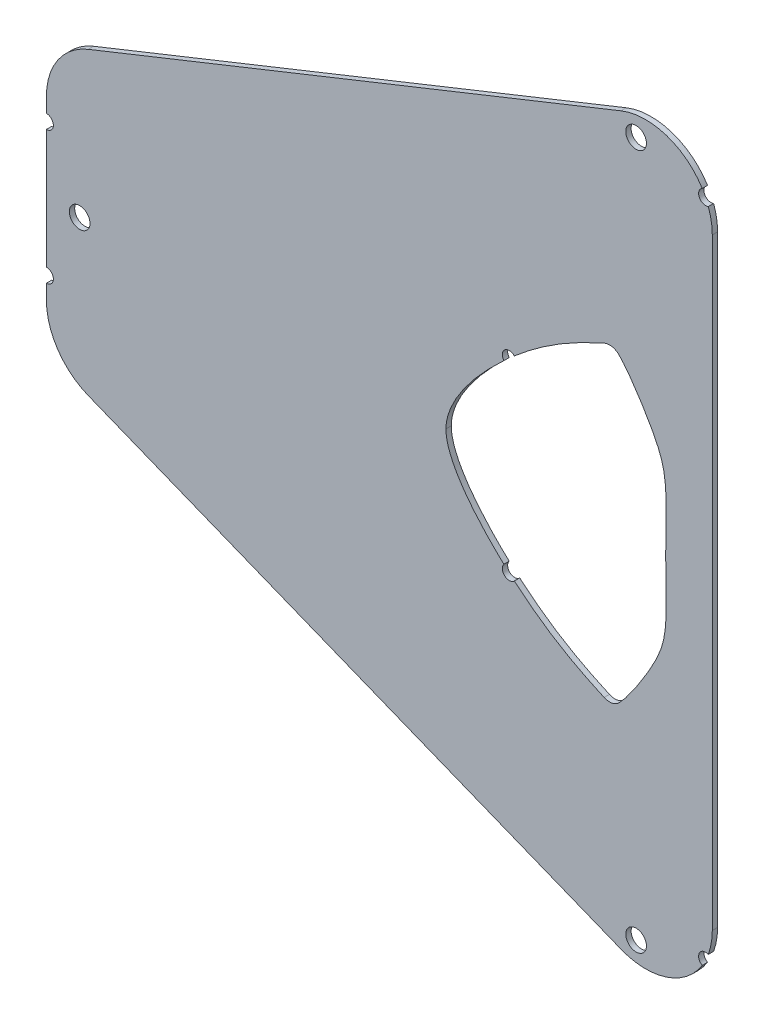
ISO-10303-21;
HEADER;
FILE_DESCRIPTION(('STEP AP214'),'2;1');
FILE_NAME('part.step','',(''),(''),'','','');
FILE_SCHEMA(('AUTOMOTIVE_DESIGN { 1 0 10303 214 1 1 1 1 }'));
ENDSEC;
DATA;
#1=APPLICATION_CONTEXT('core data for automotive mechanical design processes');
#2=APPLICATION_PROTOCOL_DEFINITION('international standard','automotive_design',2000,#1);
#3=PRODUCT_CONTEXT('',#1,'mechanical');
#4=PRODUCT('Part','Part','',(#3));
#5=PRODUCT_RELATED_PRODUCT_CATEGORY('part','',(#4));
#6=PRODUCT_DEFINITION_FORMATION('','',#4);
#7=PRODUCT_DEFINITION_CONTEXT('part definition',#1,'design');
#8=PRODUCT_DEFINITION('design','',#6,#7);
#9=PRODUCT_DEFINITION_SHAPE('','',#8);
#10=(LENGTH_UNIT() NAMED_UNIT(*) SI_UNIT(.MILLI.,.METRE.));
#11=(NAMED_UNIT(*) PLANE_ANGLE_UNIT() SI_UNIT($,.RADIAN.));
#12=(NAMED_UNIT(*) SI_UNIT($,.STERADIAN.) SOLID_ANGLE_UNIT());
#13=UNCERTAINTY_MEASURE_WITH_UNIT(LENGTH_MEASURE(1.E-05),#10,'distance_accuracy_value','');
#14=(GEOMETRIC_REPRESENTATION_CONTEXT(3) GLOBAL_UNCERTAINTY_ASSIGNED_CONTEXT((#13)) GLOBAL_UNIT_ASSIGNED_CONTEXT((#10,
#11,#12)) REPRESENTATION_CONTEXT('',''));
#15=CARTESIAN_POINT('',(0.,0.,0.));
#16=DIRECTION('',(0.,0.,1.));
#17=DIRECTION('',(1.,0.,0.));
#18=AXIS2_PLACEMENT_3D('',#15,#16,#17);
#19=CARTESIAN_POINT('',(10.,13.229670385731,0.8));
#20=DIRECTION('',(0.,0.,1.));
#21=DIRECTION('',(1.,0.,0.));
#22=AXIS2_PLACEMENT_3D('',#19,#20,#21);
#23=PLANE('',#22);
#24=CARTESIAN_POINT('',(88.5590405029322,52.1925173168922,0.8));
#25=DIRECTION('',(0.,0.,1.));
#26=DIRECTION('',(1.,0.,0.));
#27=AXIS2_PLACEMENT_3D('',#24,#25,#26);
#28=CIRCLE('',#27,1.54999999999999);
#29=CARTESIAN_POINT('',(90.1090405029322,52.1925173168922,0.8));
#30=VERTEX_POINT('',#29);
#31=EDGE_CURVE('E655',#30,#30,#28,.T.);
#32=ORIENTED_EDGE('',*,*,#31,.F.);
#33=EDGE_LOOP('',(#32));
#34=FACE_BOUND('',#33,.T.);
#35=CARTESIAN_POINT('',(69.5193173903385,-13.9038634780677,0.8));
#36=DIRECTION('',(0.,0.,1.));
#37=DIRECTION('',(-1.,0.,0.));
#38=AXIS2_PLACEMENT_3D('',#35,#36,#37);
#39=CIRCLE('',#38,1.05000000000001);
#40=CARTESIAN_POINT('',(68.7064209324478,-13.2392588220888,0.8));
#41=VERTEX_POINT('',#40);
#42=CARTESIAN_POINT('',(70.2753718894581,-14.6324796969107,0.8));
#43=VERTEX_POINT('',#42);
#44=EDGE_CURVE('E284',#41,#43,#39,.T.);
#45=ORIENTED_EDGE('',*,*,#44,.F.);
#46=CARTESIAN_POINT('',(60.,0.,0.8));
#47=CARTESIAN_POINT('',(60.0183699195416,-3.92846695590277,0.8));
#48=CARTESIAN_POINT('',(64.2193284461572,-9.10855984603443,0.8));
#49=CARTESIAN_POINT('',(68.7064209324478,-13.2392588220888,0.8));
#50=B_SPLINE_CURVE_WITH_KNOTS('',3,(#46,#47,#48,#49),.UNSPECIFIED.,.F.,.F.,(4,4),
(0.682096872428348,1.),.UNSPECIFIED.);
#51=CARTESIAN_POINT('',(60.,0.,0.8));
#52=VERTEX_POINT('',#51);
#53=EDGE_CURVE('E216',#52,#41,#50,.T.);
#54=ORIENTED_EDGE('',*,*,#53,.F.);
#55=CARTESIAN_POINT('',(68.7064209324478,13.2392588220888,0.8));
#56=CARTESIAN_POINT('',(64.2193284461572,9.10855984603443,0.8));
#57=CARTESIAN_POINT('',(60.0183699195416,3.92846695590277,0.8));
#58=CARTESIAN_POINT('',(60.,0.,0.8));
#59=B_SPLINE_CURVE_WITH_KNOTS('',3,(#55,#56,#57,#58),.UNSPECIFIED.,.F.,.F.,(4,4),
(0.682096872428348,1.),.UNSPECIFIED.);
#60=CARTESIAN_POINT('',(68.7064209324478,13.2392588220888,0.8));
#61=VERTEX_POINT('',#60);
#62=EDGE_CURVE('E507',#61,#52,#59,.T.);
#63=ORIENTED_EDGE('',*,*,#62,.F.);
#64=CARTESIAN_POINT('',(69.5193173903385,13.9038634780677,0.8));
#65=DIRECTION('',(0.,0.,1.));
#66=DIRECTION('',(1.,0.,0.));
#67=AXIS2_PLACEMENT_3D('',#64,#65,#66);
#68=CIRCLE('',#67,1.05000000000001);
#69=CARTESIAN_POINT('',(70.2753718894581,14.6324796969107,0.8));
#70=VERTEX_POINT('',#69);
#71=EDGE_CURVE('E512',#70,#61,#68,.T.);
#72=ORIENTED_EDGE('',*,*,#71,.F.);
#73=CARTESIAN_POINT('',(83.7531970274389,23.0402650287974,0.8));
#74=CARTESIAN_POINT('',(79.4383151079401,21.1026836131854,0.8));
#75=CARTESIAN_POINT('',(75.3218504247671,18.850516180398,0.8));
#76=CARTESIAN_POINT('',(70.6636592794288,14.9651158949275,0.8));
#77=CARTESIAN_POINT('',(70.2753718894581,14.6324796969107,0.8));
#78=B_SPLINE_CURVE_WITH_KNOTS('',3,(#73,#74,#75,#76,#77),.UNSPECIFIED.,.F.,.F.,(4,1,4),
(0.315115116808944,0.617749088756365,0.64517363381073),.UNSPECIFIED.);
#79=CARTESIAN_POINT('',(83.7531970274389,23.0402650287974,0.8));
#80=VERTEX_POINT('',#79);
#81=EDGE_CURVE('E534',#80,#70,#78,.T.);
#82=ORIENTED_EDGE('',*,*,#81,.F.);
#83=CARTESIAN_POINT('',(84.5724790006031,21.2157713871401,0.8));
#84=DIRECTION('',(0.,0.,1.));
#85=DIRECTION('',(-1.,0.,0.));
#86=AXIS2_PLACEMENT_3D('',#83,#84,#85);
#87=CIRCLE('',#86,2.);
#88=CARTESIAN_POINT('',(85.9795006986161,22.637140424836,0.8));
#89=VERTEX_POINT('',#88);
#90=EDGE_CURVE('E539',#89,#80,#87,.T.);
#91=ORIENTED_EDGE('',*,*,#90,.F.);
#92=CARTESIAN_POINT('',(92.9999999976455,0.,0.8));
#93=CARTESIAN_POINT('',(93.1433526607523,9.14020594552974,0.8));
#94=CARTESIAN_POINT('',(93.5324783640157,11.8989644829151,0.8));
#95=CARTESIAN_POINT('',(87.3548009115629,21.2757225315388,0.8));
#96=CARTESIAN_POINT('',(85.9795006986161,22.637140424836,0.8));
#97=B_SPLINE_CURVE_WITH_KNOTS('',3,(#92,#93,#94,#95,#96),.UNSPECIFIED.,.F.,.F.,(4,1,4),(0.,
0.584780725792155,0.920625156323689),.UNSPECIFIED.);
#98=CARTESIAN_POINT('',(92.9999999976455,0.,0.8));
#99=VERTEX_POINT('',#98);
#100=EDGE_CURVE('E544',#99,#89,#97,.T.);
#101=ORIENTED_EDGE('',*,*,#100,.F.);
#102=CARTESIAN_POINT('',(85.9795006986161,-22.637140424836,0.8));
#103=CARTESIAN_POINT('',(87.3548009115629,-21.2757225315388,0.8));
#104=CARTESIAN_POINT('',(93.5324783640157,-11.8989644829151,0.8));
#105=CARTESIAN_POINT('',(93.1433526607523,-9.14020594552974,0.8));
#106=CARTESIAN_POINT('',(92.9999999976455,0.,0.8));
#107=B_SPLINE_CURVE_WITH_KNOTS('',3,(#102,#103,#104,#105,#106),.UNSPECIFIED.,.F.,.F.,(4,1,4),
(0.,0.335844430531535,0.920625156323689),.UNSPECIFIED.);
#108=CARTESIAN_POINT('',(85.9795006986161,-22.637140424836,0.8));
#109=VERTEX_POINT('',#108);
#110=EDGE_CURVE('E549',#109,#99,#107,.T.);
#111=ORIENTED_EDGE('',*,*,#110,.F.);
#112=CARTESIAN_POINT('',(84.5724790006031,-21.2157713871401,0.8));
#113=DIRECTION('',(0.,0.,1.));
#114=DIRECTION('',(1.,0.,0.));
#115=AXIS2_PLACEMENT_3D('',#112,#113,#114);
#116=CIRCLE('',#115,2.);
#117=CARTESIAN_POINT('',(83.7531970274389,-23.0402650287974,0.8));
#118=VERTEX_POINT('',#117);
#119=EDGE_CURVE('E575',#118,#109,#116,.T.);
#120=ORIENTED_EDGE('',*,*,#119,.F.);
#121=CARTESIAN_POINT('',(70.2753718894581,-14.6324796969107,0.8));
#122=CARTESIAN_POINT('',(70.6636592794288,-14.9651158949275,0.8));
#123=CARTESIAN_POINT('',(75.321850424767,-18.850516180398,0.8));
#124=CARTESIAN_POINT('',(79.4383151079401,-21.1026836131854,0.8));
#125=CARTESIAN_POINT('',(83.7531970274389,-23.0402650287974,0.8));
#126=B_SPLINE_CURVE_WITH_KNOTS('',3,(#121,#122,#123,#124,#125),.UNSPECIFIED.,.F.,.F.,(4,1,4),
(0.315115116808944,0.342539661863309,0.64517363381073),.UNSPECIFIED.);
#127=EDGE_CURVE('E571',#43,#118,#126,.T.);
#128=ORIENTED_EDGE('',*,*,#127,.F.);
#129=EDGE_LOOP('',(#45,#54,#63,#72,#82,#91,#101,#111,#120,#128));
#130=FACE_BOUND('',#129,.T.);
#131=CARTESIAN_POINT('',(10.,13.229670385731,0.8));
#132=DIRECTION('',(0.,0.,1.));
#133=DIRECTION('',(1.,0.,0.));
#134=AXIS2_PLACEMENT_3D('',#131,#132,#133);
#135=CIRCLE('',#134,10.);
#136=CARTESIAN_POINT('',(6.28609323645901,22.5144372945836,0.8));
#137=VERTEX_POINT('',#136);
#138=CARTESIAN_POINT('',(0.,13.2296703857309,0.8));
#139=VERTEX_POINT('',#138);
#140=EDGE_CURVE('E409',#137,#139,#135,.T.);
#141=ORIENTED_EDGE('',*,*,#140,.T.);
#142=DIRECTION('',(0.,-1.,0.));
#143=VECTOR('',#142,1.);
#144=CARTESIAN_POINT('',(0.,13.2296703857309,0.8));
#145=LINE('',#144,#143);
#146=CARTESIAN_POINT('',(0.,11.05,0.8));
#147=VERTEX_POINT('',#146);
#148=EDGE_CURVE('E412',#139,#147,#145,.T.);
#149=ORIENTED_EDGE('',*,*,#148,.T.);
#150=CARTESIAN_POINT('',(0.,10.,0.8));
#151=DIRECTION('',(0.,0.,-1.));
#152=DIRECTION('',(1.,0.,0.));
#153=AXIS2_PLACEMENT_3D('',#150,#151,#152);
#154=CIRCLE('',#153,1.05);
#155=CARTESIAN_POINT('',(0.,8.95,0.8));
#156=VERTEX_POINT('',#155);
#157=EDGE_CURVE('E374',#147,#156,#154,.T.);
#158=ORIENTED_EDGE('',*,*,#157,.T.);
#159=DIRECTION('',(0.,-1.,0.));
#160=VECTOR('',#159,1.);
#161=CARTESIAN_POINT('',(0.,8.95,0.8));
#162=LINE('',#161,#160);
#163=CARTESIAN_POINT('',(0.,-8.95,0.8));
#164=VERTEX_POINT('',#163);
#165=EDGE_CURVE('E415',#156,#164,#162,.T.);
#166=ORIENTED_EDGE('',*,*,#165,.T.);
#167=CARTESIAN_POINT('',(0.,-10.,0.8));
#168=DIRECTION('',(0.,0.,-1.));
#169=DIRECTION('',(-1.,0.,0.));
#170=AXIS2_PLACEMENT_3D('',#167,#168,#169);
#171=CIRCLE('',#170,1.05);
#172=CARTESIAN_POINT('',(0.,-11.05,0.8));
#173=VERTEX_POINT('',#172);
#174=EDGE_CURVE('E417',#164,#173,#171,.T.);
#175=ORIENTED_EDGE('',*,*,#174,.T.);
#176=DIRECTION('',(0.,-1.,0.));
#177=VECTOR('',#176,1.);
#178=CARTESIAN_POINT('',(0.,-11.05,0.8));
#179=LINE('',#178,#177);
#180=CARTESIAN_POINT('',(0.,-13.2296703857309,0.8));
#181=VERTEX_POINT('',#180);
#182=EDGE_CURVE('E419',#173,#181,#179,.T.);
#183=ORIENTED_EDGE('',*,*,#182,.T.);
#184=CARTESIAN_POINT('',(10.,-13.229670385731,0.8));
#185=DIRECTION('',(0.,0.,1.));
#186=DIRECTION('',(-1.,0.,0.));
#187=AXIS2_PLACEMENT_3D('',#184,#185,#186);
#188=CIRCLE('',#187,10.);
#189=CARTESIAN_POINT('',(6.28609323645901,-22.5144372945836,0.8));
#190=VERTEX_POINT('',#189);
#191=EDGE_CURVE('E421',#181,#190,#188,.T.);
#192=ORIENTED_EDGE('',*,*,#191,.T.);
#193=DIRECTION('',(0.928476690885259,-0.371390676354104,0.));
#194=VECTOR('',#193,1.);
#195=CARTESIAN_POINT('',(86.2860932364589,-54.5144372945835,0.8));
#196=LINE('',#195,#194);
#197=CARTESIAN_POINT('',(86.2860932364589,-54.5144372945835,0.8));
#198=VERTEX_POINT('',#197);
#199=EDGE_CURVE('E423',#190,#198,#196,.T.);
#200=ORIENTED_EDGE('',*,*,#199,.T.);
#201=CARTESIAN_POINT('',(90.,-45.229670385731,0.8));
#202=DIRECTION('',(0.,0.,1.));
#203=DIRECTION('',(1.,0.,0.));
#204=AXIS2_PLACEMENT_3D('',#201,#202,#203);
#205=CIRCLE('',#204,10.);
#206=CARTESIAN_POINT('',(98.4877131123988,-50.5172715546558,0.8));
#207=VERTEX_POINT('',#206);
#208=EDGE_CURVE('E425',#198,#207,#205,.T.);
#209=ORIENTED_EDGE('',*,*,#208,.T.);
#210=CARTESIAN_POINT('',(98.995357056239,-49.5981428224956,0.8));
#211=DIRECTION('',(0.,0.,-1.));
#212=DIRECTION('',(-1.,0.,0.));
#213=AXIS2_PLACEMENT_3D('',#210,#211,#212);
#214=CIRCLE('',#213,1.05);
#215=CARTESIAN_POINT('',(99.4038271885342,-48.6308516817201,0.8));
#216=VERTEX_POINT('',#215);
#217=EDGE_CURVE('E427',#207,#216,#214,.T.);
#218=ORIENTED_EDGE('',*,*,#217,.T.);
#219=CARTESIAN_POINT('',(90.,-45.229670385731,0.8));
#220=DIRECTION('',(0.,0.,1.));
#221=DIRECTION('',(1.,0.,0.));
#222=AXIS2_PLACEMENT_3D('',#219,#220,#221);
#223=CIRCLE('',#222,10.);
#224=CARTESIAN_POINT('',(100.,-45.2296703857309,0.8));
#225=VERTEX_POINT('',#224);
#226=EDGE_CURVE('E429',#216,#225,#223,.T.);
#227=ORIENTED_EDGE('',*,*,#226,.T.);
#228=DIRECTION('',(0.,1.,0.));
#229=VECTOR('',#228,1.);
#230=CARTESIAN_POINT('',(100.,-45.2296703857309,0.8));
#231=LINE('',#230,#229);
#232=CARTESIAN_POINT('',(100.,45.2296703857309,0.8));
#233=VERTEX_POINT('',#232);
#234=EDGE_CURVE('E431',#225,#233,#231,.T.);
#235=ORIENTED_EDGE('',*,*,#234,.T.);
#236=CARTESIAN_POINT('',(90.,45.229670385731,0.8));
#237=DIRECTION('',(0.,0.,1.));
#238=DIRECTION('',(-1.,0.,0.));
#239=AXIS2_PLACEMENT_3D('',#236,#237,#238);
#240=CIRCLE('',#239,10.);
#241=CARTESIAN_POINT('',(99.4038271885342,48.6308516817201,0.8));
#242=VERTEX_POINT('',#241);
#243=EDGE_CURVE('E433',#233,#242,#240,.T.);
#244=ORIENTED_EDGE('',*,*,#243,.T.);
#245=CARTESIAN_POINT('',(98.995357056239,49.5981428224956,0.8));
#246=DIRECTION('',(0.,0.,-1.));
#247=DIRECTION('',(1.,0.,0.));
#248=AXIS2_PLACEMENT_3D('',#245,#246,#247);
#249=CIRCLE('',#248,1.05);
#250=CARTESIAN_POINT('',(98.4877131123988,50.5172715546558,0.8));
#251=VERTEX_POINT('',#250);
#252=EDGE_CURVE('E435',#242,#251,#249,.T.);
#253=ORIENTED_EDGE('',*,*,#252,.T.);
#254=CARTESIAN_POINT('',(90.,45.229670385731,0.8));
#255=DIRECTION('',(0.,0.,1.));
#256=DIRECTION('',(-1.,0.,0.));
#257=AXIS2_PLACEMENT_3D('',#254,#255,#256);
#258=CIRCLE('',#257,10.);
#259=CARTESIAN_POINT('',(86.2860932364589,54.5144372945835,0.8));
#260=VERTEX_POINT('',#259);
#261=EDGE_CURVE('E437',#251,#260,#258,.T.);
#262=ORIENTED_EDGE('',*,*,#261,.T.);
#263=DIRECTION('',(-0.928476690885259,-0.371390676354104,0.));
#264=VECTOR('',#263,1.);
#265=CARTESIAN_POINT('',(86.2860932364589,54.5144372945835,0.8));
#266=LINE('',#265,#264);
#267=EDGE_CURVE('E439',#260,#137,#266,.T.);
#268=ORIENTED_EDGE('',*,*,#267,.T.);
#269=EDGE_LOOP('',(#141,#149,#158,#166,#175,#183,#192,#200,#209,#218,#227,#235,#244,#253,#262,#268));
#270=FACE_BOUND('',#269,.T.);
#271=CARTESIAN_POINT('',(5.,0.,0.8));
#272=DIRECTION('',(0.,0.,1.));
#273=DIRECTION('',(1.,0.,0.));
#274=AXIS2_PLACEMENT_3D('',#271,#272,#273);
#275=CIRCLE('',#274,1.55);
#276=CARTESIAN_POINT('',(6.55,0.,0.8));
#277=VERTEX_POINT('',#276);
#278=EDGE_CURVE('E224',#277,#277,#275,.T.);
#279=ORIENTED_EDGE('',*,*,#278,.F.);
#280=EDGE_LOOP('',(#279));
#281=FACE_BOUND('',#280,.T.);
#282=CARTESIAN_POINT('',(88.5590405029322,-52.1925173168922,0.8));
#283=DIRECTION('',(0.,0.,1.));
#284=DIRECTION('',(-1.,0.,0.));
#285=AXIS2_PLACEMENT_3D('',#282,#283,#284);
#286=CIRCLE('',#285,1.54999999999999);
#287=CARTESIAN_POINT('',(87.0090405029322,-52.1925173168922,0.8));
#288=VERTEX_POINT('',#287);
#289=EDGE_CURVE('E644',#288,#288,#286,.T.);
#290=ORIENTED_EDGE('',*,*,#289,.F.);
#291=EDGE_LOOP('',(#290));
#292=FACE_BOUND('',#291,.T.);
#293=ADVANCED_FACE('F28',(#34,#130,#270,#281,#292),#23,.T.);
#294=CARTESIAN_POINT('',(10.,13.229670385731,0.));
#295=DIRECTION('',(0.,0.,1.));
#296=DIRECTION('',(1.,0.,0.));
#297=AXIS2_PLACEMENT_3D('',#294,#295,#296);
#298=PLANE('',#297);
#299=CARTESIAN_POINT('',(88.5590405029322,52.1925173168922,0.));
#300=DIRECTION('',(0.,0.,1.));
#301=DIRECTION('',(1.,0.,0.));
#302=AXIS2_PLACEMENT_3D('',#299,#300,#301);
#303=CIRCLE('',#302,1.54999999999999);
#304=CARTESIAN_POINT('',(90.1090405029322,52.1925173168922,0.));
#305=VERTEX_POINT('',#304);
#306=EDGE_CURVE('E650',#305,#305,#303,.T.);
#307=ORIENTED_EDGE('',*,*,#306,.T.);
#308=EDGE_LOOP('',(#307));
#309=FACE_BOUND('',#308,.T.);
#310=CARTESIAN_POINT('',(60.,0.,0.));
#311=CARTESIAN_POINT('',(60.0183699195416,-3.92846695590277,0.));
#312=CARTESIAN_POINT('',(64.2193284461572,-9.10855984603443,0.));
#313=CARTESIAN_POINT('',(68.7064209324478,-13.2392588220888,0.));
#314=B_SPLINE_CURVE_WITH_KNOTS('',3,(#310,#311,#312,#313),.UNSPECIFIED.,.F.,.F.,(4,4),
(0.682096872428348,1.),.UNSPECIFIED.);
#315=CARTESIAN_POINT('',(60.,0.,0.));
#316=VERTEX_POINT('',#315);
#317=CARTESIAN_POINT('',(68.7064209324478,-13.2392588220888,0.));
#318=VERTEX_POINT('',#317);
#319=EDGE_CURVE('E51',#316,#318,#314,.T.);
#320=ORIENTED_EDGE('',*,*,#319,.T.);
#321=CARTESIAN_POINT('',(69.5193173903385,-13.9038634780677,0.));
#322=DIRECTION('',(0.,0.,1.));
#323=DIRECTION('',(-1.,0.,0.));
#324=AXIS2_PLACEMENT_3D('',#321,#322,#323);
#325=CIRCLE('',#324,1.05000000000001);
#326=CARTESIAN_POINT('',(70.2753718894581,-14.6324796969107,0.));
#327=VERTEX_POINT('',#326);
#328=EDGE_CURVE('E203',#318,#327,#325,.T.);
#329=ORIENTED_EDGE('',*,*,#328,.T.);
#330=CARTESIAN_POINT('',(70.2753718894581,-14.6324796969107,0.));
#331=CARTESIAN_POINT('',(70.6636592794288,-14.9651158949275,0.));
#332=CARTESIAN_POINT('',(75.321850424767,-18.850516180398,0.));
#333=CARTESIAN_POINT('',(79.4383151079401,-21.1026836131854,0.));
#334=CARTESIAN_POINT('',(83.7531970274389,-23.0402650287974,0.));
#335=B_SPLINE_CURVE_WITH_KNOTS('',3,(#330,#331,#332,#333,#334),.UNSPECIFIED.,.F.,.F.,(4,1,4),
(0.315115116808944,0.342539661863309,0.64517363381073),.UNSPECIFIED.);
#336=CARTESIAN_POINT('',(83.7531970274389,-23.0402650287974,0.));
#337=VERTEX_POINT('',#336);
#338=EDGE_CURVE('E212',#327,#337,#335,.T.);
#339=ORIENTED_EDGE('',*,*,#338,.T.);
#340=CARTESIAN_POINT('',(84.5724790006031,-21.2157713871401,0.));
#341=DIRECTION('',(0.,0.,1.));
#342=DIRECTION('',(1.,0.,0.));
#343=AXIS2_PLACEMENT_3D('',#340,#341,#342);
#344=CIRCLE('',#343,2.);
#345=CARTESIAN_POINT('',(85.9795006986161,-22.637140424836,0.));
#346=VERTEX_POINT('',#345);
#347=EDGE_CURVE('E239',#337,#346,#344,.T.);
#348=ORIENTED_EDGE('',*,*,#347,.T.);
#349=CARTESIAN_POINT('',(85.9795006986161,-22.637140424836,0.));
#350=CARTESIAN_POINT('',(87.3548009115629,-21.2757225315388,0.));
#351=CARTESIAN_POINT('',(93.5324783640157,-11.8989644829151,0.));
#352=CARTESIAN_POINT('',(93.1433526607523,-9.14020594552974,0.));
#353=CARTESIAN_POINT('',(92.9999999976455,0.,0.));
#354=B_SPLINE_CURVE_WITH_KNOTS('',3,(#349,#350,#351,#352,#353),.UNSPECIFIED.,.F.,.F.,(4,1,4),
(0.,0.335844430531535,0.920625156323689),.UNSPECIFIED.);
#355=CARTESIAN_POINT('',(92.9999999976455,0.,0.));
#356=VERTEX_POINT('',#355);
#357=EDGE_CURVE('E245',#346,#356,#354,.T.);
#358=ORIENTED_EDGE('',*,*,#357,.T.);
#359=CARTESIAN_POINT('',(92.9999999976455,0.,0.));
#360=CARTESIAN_POINT('',(93.1433526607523,9.14020594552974,0.));
#361=CARTESIAN_POINT('',(93.5324783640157,11.8989644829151,0.));
#362=CARTESIAN_POINT('',(87.3548009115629,21.2757225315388,0.));
#363=CARTESIAN_POINT('',(85.9795006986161,22.637140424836,0.));
#364=B_SPLINE_CURVE_WITH_KNOTS('',3,(#359,#360,#361,#362,#363),.UNSPECIFIED.,.F.,.F.,(4,1,4),
(0.,0.584780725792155,0.920625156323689),.UNSPECIFIED.);
#365=CARTESIAN_POINT('',(85.9795006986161,22.637140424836,0.));
#366=VERTEX_POINT('',#365);
#367=EDGE_CURVE('E250',#356,#366,#364,.T.);
#368=ORIENTED_EDGE('',*,*,#367,.T.);
#369=CARTESIAN_POINT('',(84.5724790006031,21.2157713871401,0.));
#370=DIRECTION('',(0.,0.,1.));
#371=DIRECTION('',(-1.,0.,0.));
#372=AXIS2_PLACEMENT_3D('',#369,#370,#371);
#373=CIRCLE('',#372,2.);
#374=CARTESIAN_POINT('',(83.7531970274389,23.0402650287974,0.));
#375=VERTEX_POINT('',#374);
#376=EDGE_CURVE('E258',#366,#375,#373,.T.);
#377=ORIENTED_EDGE('',*,*,#376,.T.);
#378=CARTESIAN_POINT('',(83.7531970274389,23.0402650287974,0.));
#379=CARTESIAN_POINT('',(79.4383151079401,21.1026836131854,0.));
#380=CARTESIAN_POINT('',(75.3218504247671,18.850516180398,0.));
#381=CARTESIAN_POINT('',(70.6636592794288,14.9651158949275,0.));
#382=CARTESIAN_POINT('',(70.2753718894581,14.6324796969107,0.));
#383=B_SPLINE_CURVE_WITH_KNOTS('',3,(#378,#379,#380,#381,#382),.UNSPECIFIED.,.F.,.F.,(4,1,4),
(0.315115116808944,0.617749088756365,0.64517363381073),.UNSPECIFIED.);
#384=CARTESIAN_POINT('',(70.2753718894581,14.6324796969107,0.));
#385=VERTEX_POINT('',#384);
#386=EDGE_CURVE('E264',#375,#385,#383,.T.);
#387=ORIENTED_EDGE('',*,*,#386,.T.);
#388=CARTESIAN_POINT('',(69.5193173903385,13.9038634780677,0.));
#389=DIRECTION('',(0.,0.,1.));
#390=DIRECTION('',(1.,0.,0.));
#391=AXIS2_PLACEMENT_3D('',#388,#389,#390);
#392=CIRCLE('',#391,1.05000000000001);
#393=CARTESIAN_POINT('',(68.7064209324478,13.2392588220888,0.));
#394=VERTEX_POINT('',#393);
#395=EDGE_CURVE('E269',#385,#394,#392,.T.);
#396=ORIENTED_EDGE('',*,*,#395,.T.);
#397=CARTESIAN_POINT('',(68.7064209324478,13.2392588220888,0.));
#398=CARTESIAN_POINT('',(64.2193284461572,9.10855984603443,0.));
#399=CARTESIAN_POINT('',(60.0183699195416,3.92846695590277,0.));
#400=CARTESIAN_POINT('',(60.,0.,0.));
#401=B_SPLINE_CURVE_WITH_KNOTS('',3,(#397,#398,#399,#400),.UNSPECIFIED.,.F.,.F.,(4,4),
(0.682096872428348,1.),.UNSPECIFIED.);
#402=EDGE_CURVE('E223',#394,#316,#401,.T.);
#403=ORIENTED_EDGE('',*,*,#402,.T.);
#404=EDGE_LOOP('',(#320,#329,#339,#348,#358,#368,#377,#387,#396,#403));
#405=FACE_BOUND('',#404,.T.);
#406=CARTESIAN_POINT('',(10.,13.229670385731,0.));
#407=DIRECTION('',(0.,0.,1.));
#408=DIRECTION('',(1.,0.,0.));
#409=AXIS2_PLACEMENT_3D('',#406,#407,#408);
#410=CIRCLE('',#409,10.);
#411=CARTESIAN_POINT('',(6.28609323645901,22.5144372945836,0.));
#412=VERTEX_POINT('',#411);
#413=CARTESIAN_POINT('',(0.,13.2296703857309,0.));
#414=VERTEX_POINT('',#413);
#415=EDGE_CURVE('E217',#412,#414,#410,.T.);
#416=ORIENTED_EDGE('',*,*,#415,.F.);
#417=DIRECTION('',(-0.928476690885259,-0.371390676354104,0.));
#418=VECTOR('',#417,1.);
#419=CARTESIAN_POINT('',(86.2860932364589,54.5144372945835,0.));
#420=LINE('',#419,#418);
#421=CARTESIAN_POINT('',(86.2860932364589,54.5144372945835,0.));
#422=VERTEX_POINT('',#421);
#423=EDGE_CURVE('E407',#422,#412,#420,.T.);
#424=ORIENTED_EDGE('',*,*,#423,.F.);
#425=CARTESIAN_POINT('',(90.,45.229670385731,0.));
#426=DIRECTION('',(0.,0.,1.));
#427=DIRECTION('',(-1.,0.,0.));
#428=AXIS2_PLACEMENT_3D('',#425,#426,#427);
#429=CIRCLE('',#428,10.);
#430=CARTESIAN_POINT('',(98.4877131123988,50.5172715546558,0.));
#431=VERTEX_POINT('',#430);
#432=EDGE_CURVE('E405',#431,#422,#429,.T.);
#433=ORIENTED_EDGE('',*,*,#432,.F.);
#434=CARTESIAN_POINT('',(98.995357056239,49.5981428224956,0.));
#435=DIRECTION('',(0.,0.,-1.));
#436=DIRECTION('',(1.,0.,0.));
#437=AXIS2_PLACEMENT_3D('',#434,#435,#436);
#438=CIRCLE('',#437,1.05);
#439=CARTESIAN_POINT('',(99.4038271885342,48.6308516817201,0.));
#440=VERTEX_POINT('',#439);
#441=EDGE_CURVE('E403',#440,#431,#438,.T.);
#442=ORIENTED_EDGE('',*,*,#441,.F.);
#443=CARTESIAN_POINT('',(90.,45.229670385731,0.));
#444=DIRECTION('',(0.,0.,1.));
#445=DIRECTION('',(-1.,0.,0.));
#446=AXIS2_PLACEMENT_3D('',#443,#444,#445);
#447=CIRCLE('',#446,10.);
#448=CARTESIAN_POINT('',(100.,45.2296703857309,0.));
#449=VERTEX_POINT('',#448);
#450=EDGE_CURVE('E401',#449,#440,#447,.T.);
#451=ORIENTED_EDGE('',*,*,#450,.F.);
#452=DIRECTION('',(0.,1.,0.));
#453=VECTOR('',#452,1.);
#454=CARTESIAN_POINT('',(100.,45.2296703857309,0.));
#455=LINE('',#454,#453);
#456=CARTESIAN_POINT('',(100.,-45.2296703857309,0.));
#457=VERTEX_POINT('',#456);
#458=EDGE_CURVE('E399',#457,#449,#455,.T.);
#459=ORIENTED_EDGE('',*,*,#458,.F.);
#460=CARTESIAN_POINT('',(90.,-45.229670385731,0.));
#461=DIRECTION('',(0.,0.,1.));
#462=DIRECTION('',(1.,0.,0.));
#463=AXIS2_PLACEMENT_3D('',#460,#461,#462);
#464=CIRCLE('',#463,10.);
#465=CARTESIAN_POINT('',(99.4038271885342,-48.6308516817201,0.));
#466=VERTEX_POINT('',#465);
#467=EDGE_CURVE('E396',#466,#457,#464,.T.);
#468=ORIENTED_EDGE('',*,*,#467,.F.);
#469=CARTESIAN_POINT('',(98.995357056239,-49.5981428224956,0.));
#470=DIRECTION('',(0.,0.,-1.));
#471=DIRECTION('',(-1.,0.,0.));
#472=AXIS2_PLACEMENT_3D('',#469,#470,#471);
#473=CIRCLE('',#472,1.05);
#474=CARTESIAN_POINT('',(98.4877131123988,-50.5172715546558,0.));
#475=VERTEX_POINT('',#474);
#476=EDGE_CURVE('E394',#475,#466,#473,.T.);
#477=ORIENTED_EDGE('',*,*,#476,.F.);
#478=CARTESIAN_POINT('',(90.,-45.229670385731,0.));
#479=DIRECTION('',(0.,0.,1.));
#480=DIRECTION('',(1.,0.,0.));
#481=AXIS2_PLACEMENT_3D('',#478,#479,#480);
#482=CIRCLE('',#481,10.);
#483=CARTESIAN_POINT('',(86.2860932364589,-54.5144372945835,0.));
#484=VERTEX_POINT('',#483);
#485=EDGE_CURVE('E392',#484,#475,#482,.T.);
#486=ORIENTED_EDGE('',*,*,#485,.F.);
#487=DIRECTION('',(0.928476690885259,-0.371390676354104,0.));
#488=VECTOR('',#487,1.);
#489=CARTESIAN_POINT('',(86.2860932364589,-54.5144372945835,0.));
#490=LINE('',#489,#488);
#491=CARTESIAN_POINT('',(6.28609323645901,-22.5144372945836,0.));
#492=VERTEX_POINT('',#491);
#493=EDGE_CURVE('E390',#492,#484,#490,.T.);
#494=ORIENTED_EDGE('',*,*,#493,.F.);
#495=CARTESIAN_POINT('',(10.,-13.229670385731,0.));
#496=DIRECTION('',(0.,0.,1.));
#497=DIRECTION('',(-1.,0.,0.));
#498=AXIS2_PLACEMENT_3D('',#495,#496,#497);
#499=CIRCLE('',#498,10.);
#500=CARTESIAN_POINT('',(0.,-13.2296703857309,0.));
#501=VERTEX_POINT('',#500);
#502=EDGE_CURVE('E388',#501,#492,#499,.T.);
#503=ORIENTED_EDGE('',*,*,#502,.F.);
#504=DIRECTION('',(0.,-1.,0.));
#505=VECTOR('',#504,1.);
#506=CARTESIAN_POINT('',(0.,-11.05,0.));
#507=LINE('',#506,#505);
#508=CARTESIAN_POINT('',(0.,-11.05,0.));
#509=VERTEX_POINT('',#508);
#510=EDGE_CURVE('E386',#509,#501,#507,.T.);
#511=ORIENTED_EDGE('',*,*,#510,.F.);
#512=CARTESIAN_POINT('',(0.,-10.,0.));
#513=DIRECTION('',(0.,0.,-1.));
#514=DIRECTION('',(-1.,0.,0.));
#515=AXIS2_PLACEMENT_3D('',#512,#513,#514);
#516=CIRCLE('',#515,1.05);
#517=CARTESIAN_POINT('',(0.,-8.95,0.));
#518=VERTEX_POINT('',#517);
#519=EDGE_CURVE('E381',#518,#509,#516,.T.);
#520=ORIENTED_EDGE('',*,*,#519,.F.);
#521=DIRECTION('',(0.,-1.,0.));
#522=VECTOR('',#521,1.);
#523=CARTESIAN_POINT('',(0.,8.95,0.));
#524=LINE('',#523,#522);
#525=CARTESIAN_POINT('',(0.,8.95,0.));
#526=VERTEX_POINT('',#525);
#527=EDGE_CURVE('E379',#526,#518,#524,.T.);
#528=ORIENTED_EDGE('',*,*,#527,.F.);
#529=CARTESIAN_POINT('',(0.,10.,0.));
#530=DIRECTION('',(0.,0.,-1.));
#531=DIRECTION('',(1.,0.,0.));
#532=AXIS2_PLACEMENT_3D('',#529,#530,#531);
#533=CIRCLE('',#532,1.05);
#534=CARTESIAN_POINT('',(0.,11.05,0.));
#535=VERTEX_POINT('',#534);
#536=EDGE_CURVE('E370',#535,#526,#533,.T.);
#537=ORIENTED_EDGE('',*,*,#536,.F.);
#538=DIRECTION('',(0.,-1.,0.));
#539=VECTOR('',#538,1.);
#540=CARTESIAN_POINT('',(0.,13.2296703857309,0.));
#541=LINE('',#540,#539);
#542=EDGE_CURVE('E363',#414,#535,#541,.T.);
#543=ORIENTED_EDGE('',*,*,#542,.F.);
#544=EDGE_LOOP('',(#416,#424,#433,#442,#451,#459,#468,#477,#486,#494,#503,#511,#520,#528,#537,#543));
#545=FACE_BOUND('',#544,.T.);
#546=CARTESIAN_POINT('',(5.,0.,0.));
#547=DIRECTION('',(0.,0.,1.));
#548=DIRECTION('',(1.,0.,0.));
#549=AXIS2_PLACEMENT_3D('',#546,#547,#548);
#550=CIRCLE('',#549,1.55);
#551=CARTESIAN_POINT('',(6.55,0.,0.));
#552=VERTEX_POINT('',#551);
#553=EDGE_CURVE('E227',#552,#552,#550,.T.);
#554=ORIENTED_EDGE('',*,*,#553,.T.);
#555=EDGE_LOOP('',(#554));
#556=FACE_BOUND('',#555,.T.);
#557=CARTESIAN_POINT('',(88.5590405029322,-52.1925173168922,0.));
#558=DIRECTION('',(0.,0.,1.));
#559=DIRECTION('',(-1.,0.,0.));
#560=AXIS2_PLACEMENT_3D('',#557,#558,#559);
#561=CIRCLE('',#560,1.54999999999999);
#562=CARTESIAN_POINT('',(87.0090405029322,-52.1925173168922,0.));
#563=VERTEX_POINT('',#562);
#564=EDGE_CURVE('E647',#563,#563,#561,.T.);
#565=ORIENTED_EDGE('',*,*,#564,.T.);
#566=EDGE_LOOP('',(#565));
#567=FACE_BOUND('',#566,.T.);
#568=ADVANCED_FACE('F220',(#309,#405,#545,#556,#567),#298,.F.);
#569=CARTESIAN_POINT('',(10.,13.229670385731,0.8));
#570=DIRECTION('',(0.,0.,-1.));
#571=DIRECTION('',(-1.,0.,0.));
#572=AXIS2_PLACEMENT_3D('',#569,#570,#571);
#573=CYLINDRICAL_SURFACE('',#572,10.);
#574=ORIENTED_EDGE('',*,*,#415,.T.);
#575=DIRECTION('',(0.,0.,-1.));
#576=VECTOR('',#575,1.);
#577=CARTESIAN_POINT('',(0.,13.2296703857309,0.8));
#578=LINE('',#577,#576);
#579=EDGE_CURVE('E11',#139,#414,#578,.T.);
#580=ORIENTED_EDGE('',*,*,#579,.F.);
#581=ORIENTED_EDGE('',*,*,#140,.F.);
#582=DIRECTION('',(0.,0.,-1.));
#583=VECTOR('',#582,1.);
#584=CARTESIAN_POINT('',(6.28609323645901,22.5144372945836,0.8));
#585=LINE('',#584,#583);
#586=EDGE_CURVE('E441',#137,#412,#585,.T.);
#587=ORIENTED_EDGE('',*,*,#586,.T.);
#588=EDGE_LOOP('',(#574,#580,#581,#587));
#589=FACE_BOUND('',#588,.T.);
#590=ADVANCED_FACE('F30',(#589),#573,.T.);
#591=CARTESIAN_POINT('',(0.,13.2296703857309,0.8));
#592=DIRECTION('',(1.,0.,0.));
#593=DIRECTION('',(0.,0.,-1.));
#594=AXIS2_PLACEMENT_3D('',#591,#592,#593);
#595=PLANE('',#594);
#596=ORIENTED_EDGE('',*,*,#542,.T.);
#597=DIRECTION('',(0.,0.,-1.));
#598=VECTOR('',#597,1.);
#599=CARTESIAN_POINT('',(0.,11.05,0.8));
#600=LINE('',#599,#598);
#601=EDGE_CURVE('E36',#147,#535,#600,.T.);
#602=ORIENTED_EDGE('',*,*,#601,.F.);
#603=ORIENTED_EDGE('',*,*,#148,.F.);
#604=ORIENTED_EDGE('',*,*,#579,.T.);
#605=EDGE_LOOP('',(#596,#602,#603,#604));
#606=FACE_BOUND('',#605,.T.);
#607=ADVANCED_FACE('F354',(#606),#595,.F.);
#608=CARTESIAN_POINT('',(0.,10.,0.8));
#609=DIRECTION('',(0.,0.,-1.));
#610=DIRECTION('',(-1.,0.,0.));
#611=AXIS2_PLACEMENT_3D('',#608,#609,#610);
#612=CYLINDRICAL_SURFACE('',#611,1.05);
#613=ORIENTED_EDGE('',*,*,#536,.T.);
#614=DIRECTION('',(0.,0.,-1.));
#615=VECTOR('',#614,1.);
#616=CARTESIAN_POINT('',(0.,8.95,0.8));
#617=LINE('',#616,#615);
#618=EDGE_CURVE('E375',#156,#526,#617,.T.);
#619=ORIENTED_EDGE('',*,*,#618,.F.);
#620=ORIENTED_EDGE('',*,*,#157,.F.);
#621=ORIENTED_EDGE('',*,*,#601,.T.);
#622=EDGE_LOOP('',(#613,#619,#620,#621));
#623=FACE_BOUND('',#622,.T.);
#624=ADVANCED_FACE('F351',(#623),#612,.F.);
#625=CARTESIAN_POINT('',(0.,8.95,0.8));
#626=DIRECTION('',(1.,0.,0.));
#627=DIRECTION('',(0.,0.,-1.));
#628=AXIS2_PLACEMENT_3D('',#625,#626,#627);
#629=PLANE('',#628);
#630=ORIENTED_EDGE('',*,*,#527,.T.);
#631=DIRECTION('',(0.,0.,-1.));
#632=VECTOR('',#631,1.);
#633=CARTESIAN_POINT('',(0.,-8.95,0.8));
#634=LINE('',#633,#632);
#635=EDGE_CURVE('E477',#164,#518,#634,.T.);
#636=ORIENTED_EDGE('',*,*,#635,.F.);
#637=ORIENTED_EDGE('',*,*,#165,.F.);
#638=ORIENTED_EDGE('',*,*,#618,.T.);
#639=EDGE_LOOP('',(#630,#636,#637,#638));
#640=FACE_BOUND('',#639,.T.);
#641=ADVANCED_FACE('F347',(#640),#629,.F.);
#642=CARTESIAN_POINT('',(0.,-10.,0.8));
#643=DIRECTION('',(0.,0.,-1.));
#644=DIRECTION('',(-1.,0.,0.));
#645=AXIS2_PLACEMENT_3D('',#642,#643,#644);
#646=CYLINDRICAL_SURFACE('',#645,1.05);
#647=ORIENTED_EDGE('',*,*,#519,.T.);
#648=DIRECTION('',(0.,0.,-1.));
#649=VECTOR('',#648,1.);
#650=CARTESIAN_POINT('',(0.,-11.05,0.8));
#651=LINE('',#650,#649);
#652=EDGE_CURVE('E474',#173,#509,#651,.T.);
#653=ORIENTED_EDGE('',*,*,#652,.F.);
#654=ORIENTED_EDGE('',*,*,#174,.F.);
#655=ORIENTED_EDGE('',*,*,#635,.T.);
#656=EDGE_LOOP('',(#647,#653,#654,#655));
#657=FACE_BOUND('',#656,.T.);
#658=ADVANCED_FACE('F343',(#657),#646,.F.);
#659=CARTESIAN_POINT('',(0.,-11.05,0.8));
#660=DIRECTION('',(1.,0.,0.));
#661=DIRECTION('',(0.,0.,-1.));
#662=AXIS2_PLACEMENT_3D('',#659,#660,#661);
#663=PLANE('',#662);
#664=ORIENTED_EDGE('',*,*,#510,.T.);
#665=DIRECTION('',(0.,0.,-1.));
#666=VECTOR('',#665,1.);
#667=CARTESIAN_POINT('',(0.,-13.2296703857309,0.8));
#668=LINE('',#667,#666);
#669=EDGE_CURVE('E471',#181,#501,#668,.T.);
#670=ORIENTED_EDGE('',*,*,#669,.F.);
#671=ORIENTED_EDGE('',*,*,#182,.F.);
#672=ORIENTED_EDGE('',*,*,#652,.T.);
#673=EDGE_LOOP('',(#664,#670,#671,#672));
#674=FACE_BOUND('',#673,.T.);
#675=ADVANCED_FACE('F339',(#674),#663,.F.);
#676=CARTESIAN_POINT('',(10.,-13.229670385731,0.8));
#677=DIRECTION('',(0.,0.,-1.));
#678=DIRECTION('',(-1.,0.,0.));
#679=AXIS2_PLACEMENT_3D('',#676,#677,#678);
#680=CYLINDRICAL_SURFACE('',#679,10.);
#681=ORIENTED_EDGE('',*,*,#502,.T.);
#682=DIRECTION('',(0.,0.,-1.));
#683=VECTOR('',#682,1.);
#684=CARTESIAN_POINT('',(6.28609323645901,-22.5144372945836,0.8));
#685=LINE('',#684,#683);
#686=EDGE_CURVE('E468',#190,#492,#685,.T.);
#687=ORIENTED_EDGE('',*,*,#686,.F.);
#688=ORIENTED_EDGE('',*,*,#191,.F.);
#689=ORIENTED_EDGE('',*,*,#669,.T.);
#690=EDGE_LOOP('',(#681,#687,#688,#689));
#691=FACE_BOUND('',#690,.T.);
#692=ADVANCED_FACE('F335',(#691),#680,.T.);
#693=CARTESIAN_POINT('',(86.2860932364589,-54.5144372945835,0.8));
#694=DIRECTION('',(0.371390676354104,0.928476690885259,0.));
#695=DIRECTION('',(-0.928476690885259,0.371390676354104,0.));
#696=AXIS2_PLACEMENT_3D('',#693,#694,#695);
#697=PLANE('',#696);
#698=ORIENTED_EDGE('',*,*,#493,.T.);
#699=DIRECTION('',(0.,0.,-1.));
#700=VECTOR('',#699,1.);
#701=CARTESIAN_POINT('',(86.2860932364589,-54.5144372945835,0.8));
#702=LINE('',#701,#700);
#703=EDGE_CURVE('E465',#198,#484,#702,.T.);
#704=ORIENTED_EDGE('',*,*,#703,.F.);
#705=ORIENTED_EDGE('',*,*,#199,.F.);
#706=ORIENTED_EDGE('',*,*,#686,.T.);
#707=EDGE_LOOP('',(#698,#704,#705,#706));
#708=FACE_BOUND('',#707,.T.);
#709=ADVANCED_FACE('F331',(#708),#697,.F.);
#710=CARTESIAN_POINT('',(90.,-45.229670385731,0.8));
#711=DIRECTION('',(0.,0.,-1.));
#712=DIRECTION('',(-1.,0.,0.));
#713=AXIS2_PLACEMENT_3D('',#710,#711,#712);
#714=CYLINDRICAL_SURFACE('',#713,10.);
#715=ORIENTED_EDGE('',*,*,#485,.T.);
#716=DIRECTION('',(0.,0.,-1.));
#717=VECTOR('',#716,1.);
#718=CARTESIAN_POINT('',(98.4877131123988,-50.5172715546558,0.8));
#719=LINE('',#718,#717);
#720=EDGE_CURVE('E462',#207,#475,#719,.T.);
#721=ORIENTED_EDGE('',*,*,#720,.F.);
#722=ORIENTED_EDGE('',*,*,#208,.F.);
#723=ORIENTED_EDGE('',*,*,#703,.T.);
#724=EDGE_LOOP('',(#715,#721,#722,#723));
#725=FACE_BOUND('',#724,.T.);
#726=ADVANCED_FACE('F327',(#725),#714,.T.);
#727=CARTESIAN_POINT('',(98.995357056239,-49.5981428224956,0.8));
#728=DIRECTION('',(0.,0.,-1.));
#729=DIRECTION('',(-1.,0.,0.));
#730=AXIS2_PLACEMENT_3D('',#727,#728,#729);
#731=CYLINDRICAL_SURFACE('',#730,1.05);
#732=ORIENTED_EDGE('',*,*,#476,.T.);
#733=DIRECTION('',(0.,0.,-1.));
#734=VECTOR('',#733,1.);
#735=CARTESIAN_POINT('',(99.4038271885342,-48.6308516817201,0.8));
#736=LINE('',#735,#734);
#737=EDGE_CURVE('E459',#216,#466,#736,.T.);
#738=ORIENTED_EDGE('',*,*,#737,.F.);
#739=ORIENTED_EDGE('',*,*,#217,.F.);
#740=ORIENTED_EDGE('',*,*,#720,.T.);
#741=EDGE_LOOP('',(#732,#738,#739,#740));
#742=FACE_BOUND('',#741,.T.);
#743=ADVANCED_FACE('F323',(#742),#731,.F.);
#744=CARTESIAN_POINT('',(90.,-45.229670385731,0.8));
#745=DIRECTION('',(0.,0.,-1.));
#746=DIRECTION('',(-1.,0.,0.));
#747=AXIS2_PLACEMENT_3D('',#744,#745,#746);
#748=CYLINDRICAL_SURFACE('',#747,10.);
#749=ORIENTED_EDGE('',*,*,#467,.T.);
#750=DIRECTION('',(0.,0.,-1.));
#751=VECTOR('',#750,1.);
#752=CARTESIAN_POINT('',(100.,-45.2296703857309,0.8));
#753=LINE('',#752,#751);
#754=EDGE_CURVE('E456',#225,#457,#753,.T.);
#755=ORIENTED_EDGE('',*,*,#754,.F.);
#756=ORIENTED_EDGE('',*,*,#226,.F.);
#757=ORIENTED_EDGE('',*,*,#737,.T.);
#758=EDGE_LOOP('',(#749,#755,#756,#757));
#759=FACE_BOUND('',#758,.T.);
#760=ADVANCED_FACE('F319',(#759),#748,.T.);
#761=CARTESIAN_POINT('',(100.,45.2296703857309,0.8));
#762=DIRECTION('',(-1.,0.,0.));
#763=DIRECTION('',(0.,0.,1.));
#764=AXIS2_PLACEMENT_3D('',#761,#762,#763);
#765=PLANE('',#764);
#766=ORIENTED_EDGE('',*,*,#458,.T.);
#767=DIRECTION('',(0.,0.,-1.));
#768=VECTOR('',#767,1.);
#769=CARTESIAN_POINT('',(100.,45.2296703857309,0.8));
#770=LINE('',#769,#768);
#771=EDGE_CURVE('E453',#233,#449,#770,.T.);
#772=ORIENTED_EDGE('',*,*,#771,.F.);
#773=ORIENTED_EDGE('',*,*,#234,.F.);
#774=ORIENTED_EDGE('',*,*,#754,.T.);
#775=EDGE_LOOP('',(#766,#772,#773,#774));
#776=FACE_BOUND('',#775,.T.);
#777=ADVANCED_FACE('F315',(#776),#765,.F.);
#778=CARTESIAN_POINT('',(90.,45.229670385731,0.8));
#779=DIRECTION('',(0.,0.,-1.));
#780=DIRECTION('',(-1.,0.,0.));
#781=AXIS2_PLACEMENT_3D('',#778,#779,#780);
#782=CYLINDRICAL_SURFACE('',#781,10.);
#783=ORIENTED_EDGE('',*,*,#450,.T.);
#784=DIRECTION('',(0.,0.,-1.));
#785=VECTOR('',#784,1.);
#786=CARTESIAN_POINT('',(99.4038271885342,48.6308516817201,0.8));
#787=LINE('',#786,#785);
#788=EDGE_CURVE('E450',#242,#440,#787,.T.);
#789=ORIENTED_EDGE('',*,*,#788,.F.);
#790=ORIENTED_EDGE('',*,*,#243,.F.);
#791=ORIENTED_EDGE('',*,*,#771,.T.);
#792=EDGE_LOOP('',(#783,#789,#790,#791));
#793=FACE_BOUND('',#792,.T.);
#794=ADVANCED_FACE('F311',(#793),#782,.T.);
#795=CARTESIAN_POINT('',(98.995357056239,49.5981428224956,0.8));
#796=DIRECTION('',(0.,0.,-1.));
#797=DIRECTION('',(-1.,0.,0.));
#798=AXIS2_PLACEMENT_3D('',#795,#796,#797);
#799=CYLINDRICAL_SURFACE('',#798,1.05);
#800=ORIENTED_EDGE('',*,*,#441,.T.);
#801=DIRECTION('',(0.,0.,-1.));
#802=VECTOR('',#801,1.);
#803=CARTESIAN_POINT('',(98.4877131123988,50.5172715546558,0.8));
#804=LINE('',#803,#802);
#805=EDGE_CURVE('E447',#251,#431,#804,.T.);
#806=ORIENTED_EDGE('',*,*,#805,.F.);
#807=ORIENTED_EDGE('',*,*,#252,.F.);
#808=ORIENTED_EDGE('',*,*,#788,.T.);
#809=EDGE_LOOP('',(#800,#806,#807,#808));
#810=FACE_BOUND('',#809,.T.);
#811=ADVANCED_FACE('F307',(#810),#799,.F.);
#812=CARTESIAN_POINT('',(90.,45.229670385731,0.8));
#813=DIRECTION('',(0.,0.,-1.));
#814=DIRECTION('',(-1.,0.,0.));
#815=AXIS2_PLACEMENT_3D('',#812,#813,#814);
#816=CYLINDRICAL_SURFACE('',#815,10.);
#817=ORIENTED_EDGE('',*,*,#432,.T.);
#818=DIRECTION('',(0.,0.,-1.));
#819=VECTOR('',#818,1.);
#820=CARTESIAN_POINT('',(86.2860932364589,54.5144372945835,0.8));
#821=LINE('',#820,#819);
#822=EDGE_CURVE('E444',#260,#422,#821,.T.);
#823=ORIENTED_EDGE('',*,*,#822,.F.);
#824=ORIENTED_EDGE('',*,*,#261,.F.);
#825=ORIENTED_EDGE('',*,*,#805,.T.);
#826=EDGE_LOOP('',(#817,#823,#824,#825));
#827=FACE_BOUND('',#826,.T.);
#828=ADVANCED_FACE('F303',(#827),#816,.T.);
#829=CARTESIAN_POINT('',(86.2860932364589,54.5144372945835,0.8));
#830=DIRECTION('',(0.371390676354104,-0.928476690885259,0.));
#831=DIRECTION('',(0.928476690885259,0.371390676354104,0.));
#832=AXIS2_PLACEMENT_3D('',#829,#830,#831);
#833=PLANE('',#832);
#834=ORIENTED_EDGE('',*,*,#423,.T.);
#835=ORIENTED_EDGE('',*,*,#586,.F.);
#836=ORIENTED_EDGE('',*,*,#267,.F.);
#837=ORIENTED_EDGE('',*,*,#822,.T.);
#838=EDGE_LOOP('',(#834,#835,#836,#837));
#839=FACE_BOUND('',#838,.T.);
#840=ADVANCED_FACE('F293',(#839),#833,.F.);
#841=DIRECTION('',(0.,0.,-1.));
#842=VECTOR('',#841,1.);
#843=SURFACE_OF_LINEAR_EXTRUSION('',#50,#842);
#844=ORIENTED_EDGE('',*,*,#319,.F.);
#845=DIRECTION('',(0.,0.,-1.));
#846=VECTOR('',#845,1.);
#847=CARTESIAN_POINT('',(60.,0.,0.8));
#848=LINE('',#847,#846);
#849=EDGE_CURVE('E505',#52,#316,#848,.T.);
#850=ORIENTED_EDGE('',*,*,#849,.F.);
#851=ORIENTED_EDGE('',*,*,#53,.T.);
#852=DIRECTION('',(0.,0.,-1.));
#853=VECTOR('',#852,1.);
#854=CARTESIAN_POINT('',(68.7064209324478,-13.2392588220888,0.8));
#855=LINE('',#854,#853);
#856=EDGE_CURVE('E205',#41,#318,#855,.T.);
#857=ORIENTED_EDGE('',*,*,#856,.T.);
#858=EDGE_LOOP('',(#844,#850,#851,#857));
#859=FACE_BOUND('',#858,.T.);
#860=ADVANCED_FACE('F214',(#859),#843,.T.);
#861=CARTESIAN_POINT('',(69.5193173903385,-13.9038634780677,0.8));
#862=DIRECTION('',(0.,0.,-1.));
#863=DIRECTION('',(-1.,0.,0.));
#864=AXIS2_PLACEMENT_3D('',#861,#862,#863);
#865=CYLINDRICAL_SURFACE('',#864,1.05000000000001);
#866=ORIENTED_EDGE('',*,*,#328,.F.);
#867=ORIENTED_EDGE('',*,*,#856,.F.);
#868=ORIENTED_EDGE('',*,*,#44,.T.);
#869=DIRECTION('',(0.,0.,-1.));
#870=VECTOR('',#869,1.);
#871=CARTESIAN_POINT('',(70.2753718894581,-14.6324796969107,0.8));
#872=LINE('',#871,#870);
#873=EDGE_CURVE('E208',#43,#327,#872,.T.);
#874=ORIENTED_EDGE('',*,*,#873,.T.);
#875=EDGE_LOOP('',(#866,#867,#868,#874));
#876=FACE_BOUND('',#875,.T.);
#877=ADVANCED_FACE('F204',(#876),#865,.F.);
#878=DIRECTION('',(0.,0.,-1.));
#879=VECTOR('',#878,1.);
#880=SURFACE_OF_LINEAR_EXTRUSION('',#126,#879);
#881=ORIENTED_EDGE('',*,*,#338,.F.);
#882=ORIENTED_EDGE('',*,*,#873,.F.);
#883=ORIENTED_EDGE('',*,*,#127,.T.);
#884=DIRECTION('',(0.,0.,-1.));
#885=VECTOR('',#884,1.);
#886=CARTESIAN_POINT('',(83.7531970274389,-23.0402650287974,0.8));
#887=LINE('',#886,#885);
#888=EDGE_CURVE('E492',#118,#337,#887,.T.);
#889=ORIENTED_EDGE('',*,*,#888,.T.);
#890=EDGE_LOOP('',(#881,#882,#883,#889));
#891=FACE_BOUND('',#890,.T.);
#892=ADVANCED_FACE('F567',(#891),#880,.T.);
#893=CARTESIAN_POINT('',(84.5724790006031,-21.2157713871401,0.8));
#894=DIRECTION('',(0.,0.,-1.));
#895=DIRECTION('',(-1.,0.,0.));
#896=AXIS2_PLACEMENT_3D('',#893,#894,#895);
#897=CYLINDRICAL_SURFACE('',#896,2.);
#898=ORIENTED_EDGE('',*,*,#347,.F.);
#899=ORIENTED_EDGE('',*,*,#888,.F.);
#900=ORIENTED_EDGE('',*,*,#119,.T.);
#901=DIRECTION('',(0.,0.,-1.));
#902=VECTOR('',#901,1.);
#903=CARTESIAN_POINT('',(85.9795006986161,-22.637140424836,0.8));
#904=LINE('',#903,#902);
#905=EDGE_CURVE('E494',#109,#346,#904,.T.);
#906=ORIENTED_EDGE('',*,*,#905,.T.);
#907=EDGE_LOOP('',(#898,#899,#900,#906));
#908=FACE_BOUND('',#907,.T.);
#909=ADVANCED_FACE('F564',(#908),#897,.F.);
#910=DIRECTION('',(0.,0.,-1.));
#911=VECTOR('',#910,1.);
#912=SURFACE_OF_LINEAR_EXTRUSION('',#107,#911);
#913=ORIENTED_EDGE('',*,*,#357,.F.);
#914=ORIENTED_EDGE('',*,*,#905,.F.);
#915=ORIENTED_EDGE('',*,*,#110,.T.);
#916=DIRECTION('',(0.,0.,-1.));
#917=VECTOR('',#916,1.);
#918=CARTESIAN_POINT('',(92.9999999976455,0.,0.8));
#919=LINE('',#918,#917);
#920=EDGE_CURVE('E496',#99,#356,#919,.T.);
#921=ORIENTED_EDGE('',*,*,#920,.T.);
#922=EDGE_LOOP('',(#913,#914,#915,#921));
#923=FACE_BOUND('',#922,.T.);
#924=ADVANCED_FACE('F560',(#923),#912,.T.);
#925=DIRECTION('',(0.,0.,-1.));
#926=VECTOR('',#925,1.);
#927=SURFACE_OF_LINEAR_EXTRUSION('',#97,#926);
#928=ORIENTED_EDGE('',*,*,#367,.F.);
#929=ORIENTED_EDGE('',*,*,#920,.F.);
#930=ORIENTED_EDGE('',*,*,#100,.T.);
#931=DIRECTION('',(0.,0.,-1.));
#932=VECTOR('',#931,1.);
#933=CARTESIAN_POINT('',(85.9795006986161,22.637140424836,0.8));
#934=LINE('',#933,#932);
#935=EDGE_CURVE('E498',#89,#366,#934,.T.);
#936=ORIENTED_EDGE('',*,*,#935,.T.);
#937=EDGE_LOOP('',(#928,#929,#930,#936));
#938=FACE_BOUND('',#937,.T.);
#939=ADVANCED_FACE('F557',(#938),#927,.T.);
#940=CARTESIAN_POINT('',(84.5724790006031,21.2157713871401,0.8));
#941=DIRECTION('',(0.,0.,-1.));
#942=DIRECTION('',(-1.,0.,0.));
#943=AXIS2_PLACEMENT_3D('',#940,#941,#942);
#944=CYLINDRICAL_SURFACE('',#943,2.);
#945=ORIENTED_EDGE('',*,*,#376,.F.);
#946=ORIENTED_EDGE('',*,*,#935,.F.);
#947=ORIENTED_EDGE('',*,*,#90,.T.);
#948=DIRECTION('',(0.,0.,-1.));
#949=VECTOR('',#948,1.);
#950=CARTESIAN_POINT('',(83.7531970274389,23.0402650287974,0.8));
#951=LINE('',#950,#949);
#952=EDGE_CURVE('E500',#80,#375,#951,.T.);
#953=ORIENTED_EDGE('',*,*,#952,.T.);
#954=EDGE_LOOP('',(#945,#946,#947,#953));
#955=FACE_BOUND('',#954,.T.);
#956=ADVANCED_FACE('F531',(#955),#944,.F.);
#957=DIRECTION('',(0.,0.,-1.));
#958=VECTOR('',#957,1.);
#959=SURFACE_OF_LINEAR_EXTRUSION('',#78,#958);
#960=ORIENTED_EDGE('',*,*,#386,.F.);
#961=ORIENTED_EDGE('',*,*,#952,.F.);
#962=ORIENTED_EDGE('',*,*,#81,.T.);
#963=DIRECTION('',(0.,0.,-1.));
#964=VECTOR('',#963,1.);
#965=CARTESIAN_POINT('',(70.2753718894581,14.6324796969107,0.8));
#966=LINE('',#965,#964);
#967=EDGE_CURVE('E502',#70,#385,#966,.T.);
#968=ORIENTED_EDGE('',*,*,#967,.T.);
#969=EDGE_LOOP('',(#960,#961,#962,#968));
#970=FACE_BOUND('',#969,.T.);
#971=ADVANCED_FACE('F527',(#970),#959,.T.);
#972=CARTESIAN_POINT('',(69.5193173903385,13.9038634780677,0.8));
#973=DIRECTION('',(0.,0.,-1.));
#974=DIRECTION('',(-1.,0.,0.));
#975=AXIS2_PLACEMENT_3D('',#972,#973,#974);
#976=CYLINDRICAL_SURFACE('',#975,1.05000000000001);
#977=ORIENTED_EDGE('',*,*,#395,.F.);
#978=ORIENTED_EDGE('',*,*,#967,.F.);
#979=ORIENTED_EDGE('',*,*,#71,.T.);
#980=DIRECTION('',(0.,0.,-1.));
#981=VECTOR('',#980,1.);
#982=CARTESIAN_POINT('',(68.7064209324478,13.2392588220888,0.8));
#983=LINE('',#982,#981);
#984=EDGE_CURVE('E43',#61,#394,#983,.T.);
#985=ORIENTED_EDGE('',*,*,#984,.T.);
#986=EDGE_LOOP('',(#977,#978,#979,#985));
#987=FACE_BOUND('',#986,.T.);
#988=ADVANCED_FACE('F523',(#987),#976,.F.);
#989=DIRECTION('',(0.,0.,-1.));
#990=VECTOR('',#989,1.);
#991=SURFACE_OF_LINEAR_EXTRUSION('',#59,#990);
#992=ORIENTED_EDGE('',*,*,#402,.F.);
#993=ORIENTED_EDGE('',*,*,#984,.F.);
#994=ORIENTED_EDGE('',*,*,#62,.T.);
#995=ORIENTED_EDGE('',*,*,#849,.T.);
#996=EDGE_LOOP('',(#992,#993,#994,#995));
#997=FACE_BOUND('',#996,.T.);
#998=ADVANCED_FACE('F518',(#997),#991,.T.);
#999=CARTESIAN_POINT('',(5.,0.,0.8));
#1000=DIRECTION('',(0.,0.,-1.));
#1001=DIRECTION('',(-1.,0.,0.));
#1002=AXIS2_PLACEMENT_3D('',#999,#1000,#1001);
#1003=CYLINDRICAL_SURFACE('',#1002,1.55);
#1004=ORIENTED_EDGE('',*,*,#278,.T.);
#1005=EDGE_LOOP('',(#1004));
#1006=FACE_BOUND('',#1005,.T.);
#1007=ORIENTED_EDGE('',*,*,#553,.F.);
#1008=EDGE_LOOP('',(#1007));
#1009=FACE_BOUND('',#1008,.T.);
#1010=ADVANCED_FACE('F522',(#1006,#1009),#1003,.F.);
#1011=CARTESIAN_POINT('',(88.5590405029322,52.1925173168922,0.8));
#1012=DIRECTION('',(0.,0.,-1.));
#1013=DIRECTION('',(-1.,0.,0.));
#1014=AXIS2_PLACEMENT_3D('',#1011,#1012,#1013);
#1015=CYLINDRICAL_SURFACE('',#1014,1.54999999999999);
#1016=ORIENTED_EDGE('',*,*,#31,.T.);
#1017=EDGE_LOOP('',(#1016));
#1018=FACE_BOUND('',#1017,.T.);
#1019=ORIENTED_EDGE('',*,*,#306,.F.);
#1020=EDGE_LOOP('',(#1019));
#1021=FACE_BOUND('',#1020,.T.);
#1022=ADVANCED_FACE('F624',(#1018,#1021),#1015,.F.);
#1023=CARTESIAN_POINT('',(88.5590405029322,-52.1925173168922,0.8));
#1024=DIRECTION('',(0.,0.,-1.));
#1025=DIRECTION('',(-1.,0.,0.));
#1026=AXIS2_PLACEMENT_3D('',#1023,#1024,#1025);
#1027=CYLINDRICAL_SURFACE('',#1026,1.54999999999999);
#1028=ORIENTED_EDGE('',*,*,#289,.T.);
#1029=EDGE_LOOP('',(#1028));
#1030=FACE_BOUND('',#1029,.T.);
#1031=ORIENTED_EDGE('',*,*,#564,.F.);
#1032=EDGE_LOOP('',(#1031));
#1033=FACE_BOUND('',#1032,.T.);
#1034=ADVANCED_FACE('F631',(#1030,#1033),#1027,.F.);
#1035=CLOSED_SHELL('',(#293,#568,#590,#607,#624,#641,#658,#675,#692,#709,#726,#743,#760,#777,
#794,#811,#828,#840,#860,#877,#892,#909,#924,#939,#956,#971,#988,#998,#1010,#1022,#1034));
#1036=MANIFOLD_SOLID_BREP('B2',#1035);
#1037=ADVANCED_BREP_SHAPE_REPRESENTATION('',(#18,#1036),#14);
#1038=SHAPE_DEFINITION_REPRESENTATION(#9,#1037);
ENDSEC;
END-ISO-10303-21;
